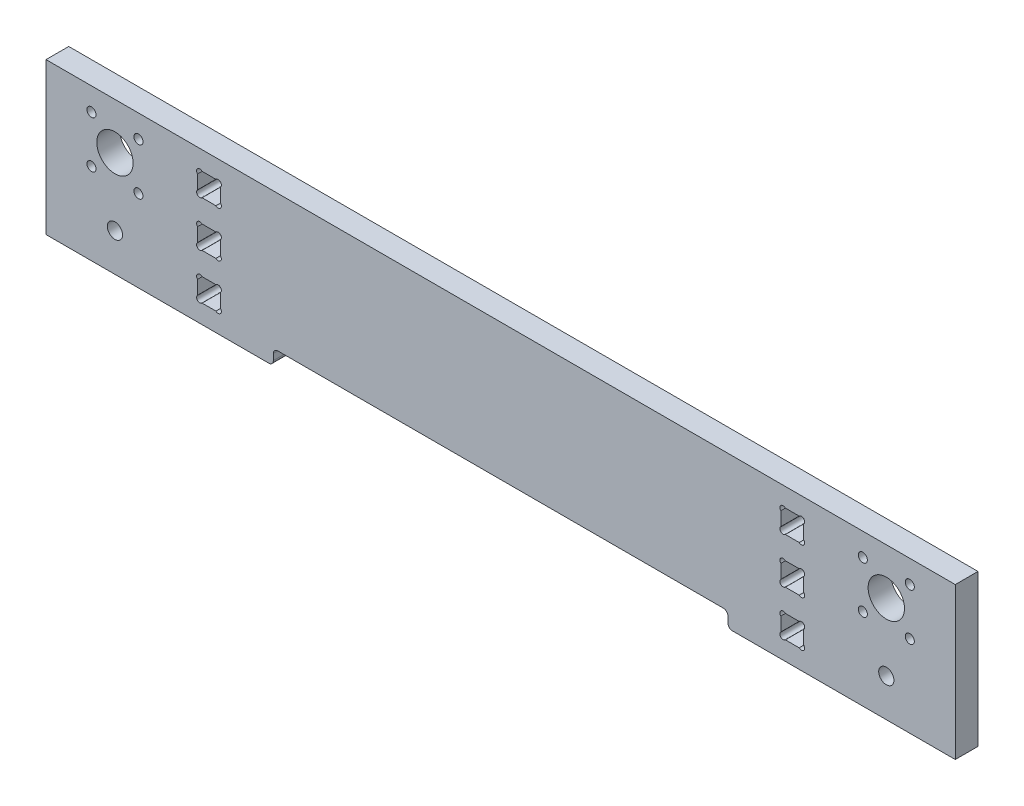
from build123d import *

# Parameters (mm, degrees)
AUFSATZ_LINEAR_AUSTRAGEN1_DEPTH = 15
SKIZZE2_R                       = 3
SKIZZE2_R_2                     = 12
SCHNITT_LINEAR_AUSTRAGEN1_DEPTH = 15
SKIZZE4_R                       = 5.025
SCHNITT_LINEAR_AUSTRAGEN2_DEPTH = 7.5
VERRUNDUNG1_R                   = 3


with BuildPart() as part:
    # Skizze1 → Aufsatz-Linear austragen1 (new body)
    with BuildSketch(Plane.XY):
        Polygon((600, 0), (450, 0), (450, 10), (150, 10), (150, 0), (0, 0), (0, 100), (600, 100), align=None)
    extrude(amount=AUFSATZ_LINEAR_AUSTRAGEN1_DEPTH)

    # Skizze2 → Schnitt-Linear austragen1 (cut)
    with BuildSketch(Plane.XY.offset(15)):
        with Locations((539, 85)):
            Circle(SKIZZE2_R)
        with Locations((570, 85)):
            Circle(SKIZZE2_R)
        with Locations((539, 54)):
            Circle(SKIZZE2_R)
        with Locations((570, 54)):
            Circle(SKIZZE2_R)
        with Locations((554.5, 69.5)):
            Circle(SKIZZE2_R_2)
        with Locations((554.5, 25)):
            Circle(SKIZZE2_R)
        with Locations((61, 85)):
            Circle(SKIZZE2_R)
        with Locations((45.5, 69.5)):
            Circle(SKIZZE2_R_2)
        with Locations((45.5, 25)):
            Circle(SKIZZE2_R)
        with Locations((30, 54)):
            Circle(SKIZZE2_R)
        with Locations((61, 54)):
            Circle(SKIZZE2_R)
        with Locations((30, 85)):
            Circle(SKIZZE2_R)
        with BuildLine():
            Line((500, 45.45), (500, 54.55))
            ThreePointArc((500, 54.55), (500, 57.55), (497, 57.55))
            Line((497, 57.55), (487.9, 57.55))
            ThreePointArc((487.9, 57.55), (484.9, 57.55), (484.9, 54.55))
            Line((484.9, 54.55), (484.9, 45.45))
            ThreePointArc((484.9, 45.45), (484.9, 42.45), (487.9, 42.45))
            Line((487.9, 42.45), (497, 42.45))
            ThreePointArc((497, 42.45), (500, 42.45), (500, 45.45))
        make_face()
        with BuildLine():
            Line((500, 75.55), (500, 84.65))
            ThreePointArc((500, 84.65), (500, 87.65), (497, 87.65))
            Line((497, 87.65), (487.9, 87.65))
            ThreePointArc((487.9, 87.65), (484.9, 87.65), (484.9, 84.65))
            Line((484.9, 84.65), (484.9, 75.55))
            ThreePointArc((484.9, 75.55), (484.9, 72.55), (487.9, 72.55))
            Line((487.9, 72.55), (497, 72.55))
            ThreePointArc((497, 72.55), (500, 72.55), (500, 75.55))
        make_face()
        with BuildLine():
            Line((115.1, 45.45), (115.1, 54.55))
            ThreePointArc((115.1, 54.55), (115.1, 57.55), (112.1, 57.55))
            Line((112.1, 57.55), (103, 57.55))
            ThreePointArc((103, 57.55), (100, 57.55), (100, 54.55))
            Line((100, 54.55), (100, 45.45))
            ThreePointArc((100, 45.45), (100, 42.45), (103, 42.45))
            Line((103, 42.45), (112.1, 42.45))
            ThreePointArc((112.1, 42.45), (115.1, 42.45), (115.1, 45.45))
        make_face()
        with BuildLine():
            Line((115.1, 75.55), (115.1, 84.65))
            ThreePointArc((115.1, 84.65), (115.1, 87.65), (112.1, 87.65))
            Line((112.1, 87.65), (103, 87.65))
            ThreePointArc((103, 87.65), (100, 87.65), (100, 84.65))
            Line((100, 84.65), (100, 75.55))
            ThreePointArc((100, 75.55), (100, 72.55), (103, 72.55))
            Line((103, 72.55), (112.1, 72.55))
            ThreePointArc((112.1, 72.55), (115.1, 72.55), (115.1, 75.55))
        make_face()
        with BuildLine():
            Line((500, 15.35), (500, 24.45))
            ThreePointArc((500, 24.45), (500, 27.45), (497, 27.45))
            Line((497, 27.45), (487.9, 27.45))
            ThreePointArc((487.9, 27.45), (484.9, 27.45), (484.9, 24.45))
            Line((484.9, 24.45), (484.9, 15.35))
            ThreePointArc((484.9, 15.35), (484.9, 12.35), (487.9, 12.35))
            Line((487.9, 12.35), (497, 12.35))
            ThreePointArc((497, 12.35), (500, 12.35), (500, 15.35))
        make_face()
        with BuildLine():
            Line((115.1, 15.35), (115.1, 24.45))
            ThreePointArc((115.1, 24.45), (115.1, 27.45), (112.1, 27.45))
            Line((112.1, 27.45), (103, 27.45))
            ThreePointArc((103, 27.45), (100, 27.45), (100, 24.45))
            Line((100, 24.45), (100, 15.35))
            ThreePointArc((100, 15.35), (100, 12.35), (103, 12.35))
            Line((103, 12.35), (112.1, 12.35))
            ThreePointArc((112.1, 12.35), (115.1, 12.35), (115.1, 15.35))
        make_face()
    extrude(amount=-SCHNITT_LINEAR_AUSTRAGEN1_DEPTH, mode=Mode.SUBTRACT)

    # Skizze4 → Schnitt-Linear austragen2 (cut)
    with BuildSketch(Plane.XY.offset(15)):
        with Locations((554.5, 25)):
            Circle(SKIZZE4_R)
        with Locations((45.5, 25)):
            Circle(SKIZZE4_R)
    extrude(amount=-SCHNITT_LINEAR_AUSTRAGEN2_DEPTH, mode=Mode.SUBTRACT)

    # Verrundung1
    verrundung1_edges = [part.edges().sort_by_distance(p)[0] for p in [
        (450, 0, 7.5),
        (450, 10, 7.5),
        (150, 10, 7.5),
        (150, 0, 7.5),
    ]]
    fillet(verrundung1_edges, radius=VERRUNDUNG1_R)


solid = part.part
